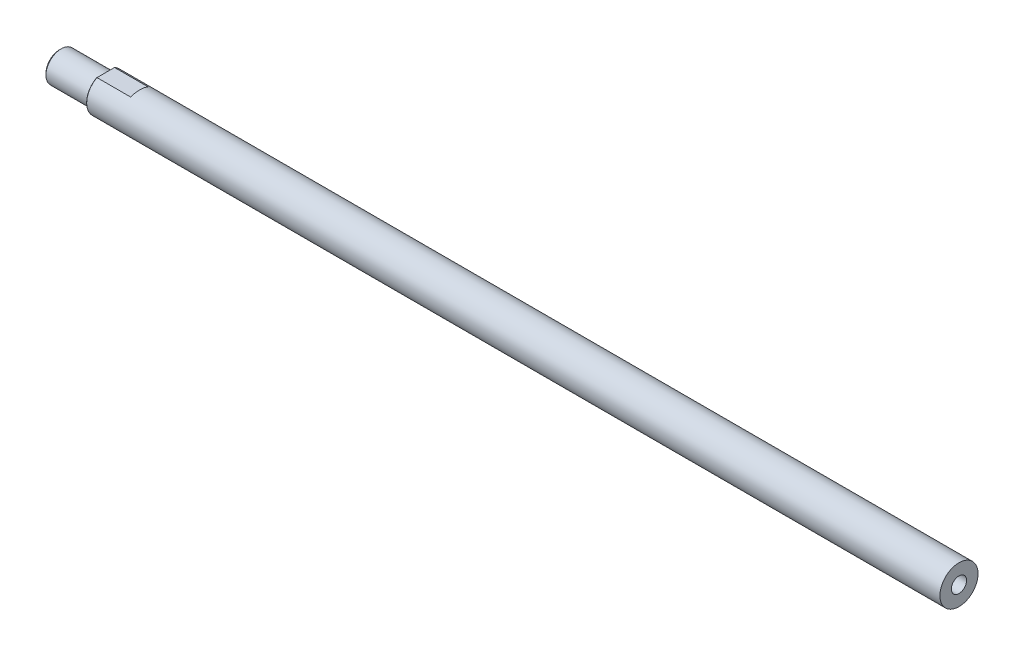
ISO-10303-21;
HEADER;
FILE_DESCRIPTION(('STEP AP214'),'2;1');
FILE_NAME('part.step','',(''),(''),'','','');
FILE_SCHEMA(('AUTOMOTIVE_DESIGN { 1 0 10303 214 1 1 1 1 }'));
ENDSEC;
DATA;
#1=APPLICATION_CONTEXT('core data for automotive mechanical design processes');
#2=APPLICATION_PROTOCOL_DEFINITION('international standard','automotive_design',2000,#1);
#3=PRODUCT_CONTEXT('',#1,'mechanical');
#4=PRODUCT('Part','Part','',(#3));
#5=PRODUCT_RELATED_PRODUCT_CATEGORY('part','',(#4));
#6=PRODUCT_DEFINITION_FORMATION('','',#4);
#7=PRODUCT_DEFINITION_CONTEXT('part definition',#1,'design');
#8=PRODUCT_DEFINITION('design','',#6,#7);
#9=PRODUCT_DEFINITION_SHAPE('','',#8);
#10=(LENGTH_UNIT() NAMED_UNIT(*) SI_UNIT(.MILLI.,.METRE.));
#11=(NAMED_UNIT(*) PLANE_ANGLE_UNIT() SI_UNIT($,.RADIAN.));
#12=(NAMED_UNIT(*) SI_UNIT($,.STERADIAN.) SOLID_ANGLE_UNIT());
#13=UNCERTAINTY_MEASURE_WITH_UNIT(LENGTH_MEASURE(1.E-05),#10,'distance_accuracy_value','');
#14=(GEOMETRIC_REPRESENTATION_CONTEXT(3) GLOBAL_UNCERTAINTY_ASSIGNED_CONTEXT((#13)) GLOBAL_UNIT_ASSIGNED_CONTEXT((#10,
#11,#12)) REPRESENTATION_CONTEXT('',''));
#15=CARTESIAN_POINT('',(0.,0.,0.));
#16=DIRECTION('',(0.,0.,1.));
#17=DIRECTION('',(1.,0.,0.));
#18=AXIS2_PLACEMENT_3D('',#15,#16,#17);
#19=CARTESIAN_POINT('',(-19.05,0.,0.));
#20=DIRECTION('',(1.,0.,0.));
#21=DIRECTION('',(0.,0.,-1.));
#22=AXIS2_PLACEMENT_3D('',#19,#20,#21);
#23=PLANE('',#22);
#24=CARTESIAN_POINT('',(-19.05,0.,0.));
#25=DIRECTION('',(1.,0.,0.));
#26=DIRECTION('',(0.,0.,-1.));
#27=AXIS2_PLACEMENT_3D('',#24,#25,#26);
#28=CIRCLE('',#27,5.58799999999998);
#29=CARTESIAN_POINT('',(-19.05,0.,-5.58799999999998));
#30=VERTEX_POINT('',#29);
#31=EDGE_CURVE('E87',#30,#30,#28,.F.);
#32=ORIENTED_EDGE('',*,*,#31,.T.);
#33=EDGE_LOOP('',(#32));
#34=FACE_BOUND('',#33,.T.);
#35=CARTESIAN_POINT('',(-19.05,0.,0.));
#36=DIRECTION('',(-1.,0.,0.));
#37=DIRECTION('',(0.,0.,1.));
#38=AXIS2_PLACEMENT_3D('',#35,#36,#37);
#39=CIRCLE('',#38,3.4544);
#40=CARTESIAN_POINT('',(-19.05,0.,3.4544));
#41=VERTEX_POINT('',#40);
#42=EDGE_CURVE('E96',#41,#41,#39,.T.);
#43=ORIENTED_EDGE('',*,*,#42,.F.);
#44=EDGE_LOOP('',(#43));
#45=FACE_BOUND('',#44,.T.);
#46=ADVANCED_FACE('F36',(#34,#45),#23,.F.);
#47=CARTESIAN_POINT('',(-34.7533783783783,0.,0.));
#48=DIRECTION('',(-1.,0.,0.));
#49=DIRECTION('',(0.,0.,1.));
#50=AXIS2_PLACEMENT_3D('',#47,#48,#49);
#51=CYLINDRICAL_SURFACE('',#50,6.35);
#52=CARTESIAN_POINT('',(-0.380999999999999,0.,0.));
#53=DIRECTION('',(1.,0.,0.));
#54=DIRECTION('',(0.,0.,-1.));
#55=AXIS2_PLACEMENT_3D('',#52,#53,#54);
#56=CIRCLE('',#55,6.35);
#57=CARTESIAN_POINT('',(-0.380999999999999,0.,-6.35));
#58=VERTEX_POINT('',#57);
#59=EDGE_CURVE('E113',#58,#58,#56,.F.);
#60=ORIENTED_EDGE('',*,*,#59,.T.);
#61=EDGE_LOOP('',(#60));
#62=FACE_BOUND('',#61,.T.);
#63=CARTESIAN_POINT('',(-18.288,0.,0.));
#64=DIRECTION('',(1.,0.,0.));
#65=DIRECTION('',(0.,0.,-1.));
#66=AXIS2_PLACEMENT_3D('',#63,#64,#65);
#67=CIRCLE('',#66,6.35);
#68=CARTESIAN_POINT('',(-18.288,0.,-6.35));
#69=VERTEX_POINT('',#68);
#70=EDGE_CURVE('E110',#69,#69,#67,.T.);
#71=ORIENTED_EDGE('',*,*,#70,.T.);
#72=EDGE_LOOP('',(#71));
#73=FACE_BOUND('',#72,.T.);
#74=ADVANCED_FACE('F146',(#62,#73),#51,.T.);
#75=CARTESIAN_POINT('',(0.,6.35,0.));
#76=DIRECTION('',(1.,0.,0.));
#77=DIRECTION('',(0.,0.,-1.));
#78=AXIS2_PLACEMENT_3D('',#75,#76,#77);
#79=PLANE('',#78);
#80=CARTESIAN_POINT('',(0.,0.,0.));
#81=DIRECTION('',(1.,0.,0.));
#82=DIRECTION('',(0.,0.,-1.));
#83=AXIS2_PLACEMENT_3D('',#80,#81,#82);
#84=CIRCLE('',#83,6.731);
#85=CARTESIAN_POINT('',(0.,0.,-6.731));
#86=VERTEX_POINT('',#85);
#87=EDGE_CURVE('E116',#86,#86,#84,.T.);
#88=ORIENTED_EDGE('',*,*,#87,.T.);
#89=EDGE_LOOP('',(#88));
#90=FACE_BOUND('',#89,.T.);
#91=CARTESIAN_POINT('',(0.,0.,0.));
#92=DIRECTION('',(1.,0.,0.));
#93=DIRECTION('',(0.,0.,-1.));
#94=AXIS2_PLACEMENT_3D('',#91,#92,#93);
#95=CIRCLE('',#94,7.68350000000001);
#96=CARTESIAN_POINT('',(0.,6.79449999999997,-3.58760951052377));
#97=VERTEX_POINT('',#96);
#98=CARTESIAN_POINT('',(0.,6.79449999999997,3.58760951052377));
#99=VERTEX_POINT('',#98);
#100=EDGE_CURVE('E119',#97,#99,#95,.F.);
#101=ORIENTED_EDGE('',*,*,#100,.T.);
#102=DIRECTION('',(0.,0.,-1.));
#103=VECTOR('',#102,1.);
#104=CARTESIAN_POINT('',(0.,6.79449999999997,0.));
#105=LINE('',#104,#103);
#106=EDGE_CURVE('E11',#99,#97,#105,.T.);
#107=ORIENTED_EDGE('',*,*,#106,.T.);
#108=EDGE_LOOP('',(#101,#107));
#109=FACE_BOUND('',#108,.T.);
#110=ADVANCED_FACE('F150',(#90,#109),#79,.F.);
#111=CARTESIAN_POINT('',(-34.7533783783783,0.,0.));
#112=DIRECTION('',(-1.,0.,0.));
#113=DIRECTION('',(0.,0.,1.));
#114=AXIS2_PLACEMENT_3D('',#111,#112,#113);
#115=CYLINDRICAL_SURFACE('',#114,7.9375);
#116=DIRECTION('',(-1.,0.,0.));
#117=VECTOR('',#116,1.);
#118=CARTESIAN_POINT('',(-34.7533783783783,7.0485,3.65000739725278));
#119=LINE('',#118,#117);
#120=CARTESIAN_POINT('',(14.224,7.0485,3.65000739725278));
#121=VERTEX_POINT('',#120);
#122=CARTESIAN_POINT('',(0.253999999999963,7.0485,3.65000739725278));
#123=VERTEX_POINT('',#122);
#124=EDGE_CURVE('E74',#121,#123,#119,.T.);
#125=ORIENTED_EDGE('',*,*,#124,.T.);
#126=CARTESIAN_POINT('',(0.253999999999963,0.,0.));
#127=DIRECTION('',(1.,0.,0.));
#128=DIRECTION('',(0.,0.,-1.));
#129=AXIS2_PLACEMENT_3D('',#126,#127,#128);
#130=CIRCLE('',#129,7.9375);
#131=CARTESIAN_POINT('',(0.253999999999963,7.0485,-3.65000739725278));
#132=VERTEX_POINT('',#131);
#133=EDGE_CURVE('E121',#123,#132,#130,.T.);
#134=ORIENTED_EDGE('',*,*,#133,.T.);
#135=DIRECTION('',(-1.,0.,0.));
#136=VECTOR('',#135,1.);
#137=CARTESIAN_POINT('',(-34.7533783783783,7.0485,-3.65000739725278));
#138=LINE('',#137,#136);
#139=CARTESIAN_POINT('',(14.224,7.0485,-3.65000739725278));
#140=VERTEX_POINT('',#139);
#141=EDGE_CURVE('E76',#132,#140,#138,.F.);
#142=ORIENTED_EDGE('',*,*,#141,.T.);
#143=CARTESIAN_POINT('',(12.3353601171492,0.,0.));
#144=DIRECTION('',(0.965925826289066,-0.25881904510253,0.));
#145=DIRECTION('',(-0.25881904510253,-0.965925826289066,0.));
#146=AXIS2_PLACEMENT_3D('',#143,#144,#145);
#147=ELLIPSE('',#146,8.21750468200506,7.9375);
#148=EDGE_CURVE('E69',#140,#121,#147,.T.);
#149=ORIENTED_EDGE('',*,*,#148,.T.);
#150=EDGE_LOOP('',(#125,#134,#142,#149));
#151=FACE_BOUND('',#150,.T.);
#152=CARTESIAN_POINT('',(355.6,0.,0.));
#153=DIRECTION('',(-1.,0.,0.));
#154=DIRECTION('',(0.,0.,1.));
#155=AXIS2_PLACEMENT_3D('',#152,#153,#154);
#156=CIRCLE('',#155,7.9375);
#157=CARTESIAN_POINT('',(355.6,0.,7.9375));
#158=VERTEX_POINT('',#157);
#159=EDGE_CURVE('E102',#158,#158,#156,.T.);
#160=ORIENTED_EDGE('',*,*,#159,.T.);
#161=EDGE_LOOP('',(#160));
#162=FACE_BOUND('',#161,.T.);
#163=ADVANCED_FACE('F71',(#151,#162),#115,.T.);
#164=CARTESIAN_POINT('',(355.6,7.9375,0.));
#165=DIRECTION('',(-1.,0.,0.));
#166=DIRECTION('',(0.,0.,1.));
#167=AXIS2_PLACEMENT_3D('',#164,#165,#166);
#168=PLANE('',#167);
#169=CARTESIAN_POINT('',(355.6,0.,0.));
#170=DIRECTION('',(1.,0.,0.));
#171=DIRECTION('',(0.,0.,-1.));
#172=AXIS2_PLACEMENT_3D('',#169,#170,#171);
#173=CIRCLE('',#172,3.175);
#174=CARTESIAN_POINT('',(355.6,0.,-3.175));
#175=VERTEX_POINT('',#174);
#176=EDGE_CURVE('E90',#175,#175,#173,.T.);
#177=ORIENTED_EDGE('',*,*,#176,.F.);
#178=EDGE_LOOP('',(#177));
#179=FACE_BOUND('',#178,.T.);
#180=ORIENTED_EDGE('',*,*,#159,.F.);
#181=EDGE_LOOP('',(#180));
#182=FACE_BOUND('',#181,.T.);
#183=ADVANCED_FACE('F157',(#179,#182),#168,.F.);
#184=CARTESIAN_POINT('',(-3.175,0.,0.));
#185=DIRECTION('',(-1.,0.,0.));
#186=DIRECTION('',(0.,0.,1.));
#187=AXIS2_PLACEMENT_3D('',#184,#185,#186);
#188=CONICAL_SURFACE('',#187,3.4544,1.02974425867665);
#189=CARTESIAN_POINT('',(-3.00711954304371,0.,0.));
#190=DIRECTION('',(-1.,0.,0.));
#191=DIRECTION('',(0.,0.,1.));
#192=AXIS2_PLACEMENT_3D('',#189,#190,#191);
#193=CIRCLE('',#192,3.175);
#194=CARTESIAN_POINT('',(-3.00711954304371,0.,-3.175));
#195=VERTEX_POINT('',#194);
#196=EDGE_CURVE('E93',#195,#195,#193,.F.);
#197=ORIENTED_EDGE('',*,*,#196,.T.);
#198=EDGE_LOOP('',(#197));
#199=FACE_BOUND('',#198,.T.);
#200=CARTESIAN_POINT('',(-3.175,0.,0.));
#201=DIRECTION('',(-1.,0.,0.));
#202=DIRECTION('',(0.,0.,1.));
#203=AXIS2_PLACEMENT_3D('',#200,#201,#202);
#204=CIRCLE('',#203,3.4544);
#205=CARTESIAN_POINT('',(-3.175,0.,3.4544));
#206=VERTEX_POINT('',#205);
#207=EDGE_CURVE('E99',#206,#206,#204,.T.);
#208=ORIENTED_EDGE('',*,*,#207,.T.);
#209=EDGE_LOOP('',(#208));
#210=FACE_BOUND('',#209,.T.);
#211=ADVANCED_FACE('F160',(#199,#210),#188,.F.);
#212=CARTESIAN_POINT('',(-19.05,0.,0.));
#213=DIRECTION('',(-1.,0.,0.));
#214=DIRECTION('',(0.,0.,1.));
#215=AXIS2_PLACEMENT_3D('',#212,#213,#214);
#216=CYLINDRICAL_SURFACE('',#215,3.4544);
#217=ORIENTED_EDGE('',*,*,#207,.F.);
#218=EDGE_LOOP('',(#217));
#219=FACE_BOUND('',#218,.T.);
#220=ORIENTED_EDGE('',*,*,#42,.T.);
#221=EDGE_LOOP('',(#220));
#222=FACE_BOUND('',#221,.T.);
#223=ADVANCED_FACE('F164',(#219,#222),#216,.F.);
#224=CARTESIAN_POINT('',(-19.05,0.,0.));
#225=DIRECTION('',(1.,0.,0.));
#226=DIRECTION('',(0.,0.,-1.));
#227=AXIS2_PLACEMENT_3D('',#224,#225,#226);
#228=CYLINDRICAL_SURFACE('',#227,3.175);
#229=CARTESIAN_POINT('',(355.6,0.,-3.175));
#230=CARTESIAN_POINT('',(351.864509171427,0.,-3.175));
#231=CARTESIAN_POINT('',(348.129018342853,0.,-3.175));
#232=CARTESIAN_POINT('',(340.658036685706,0.,-3.175));
#233=CARTESIAN_POINT('',(336.922545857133,0.,-3.175));
#234=CARTESIAN_POINT('',(329.451564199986,0.,-3.175));
#235=CARTESIAN_POINT('',(325.716073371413,0.,-3.175));
#236=CARTESIAN_POINT('',(318.245091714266,0.,-3.175));
#237=CARTESIAN_POINT('',(314.509600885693,0.,-3.175));
#238=CARTESIAN_POINT('',(307.038619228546,0.,-3.175));
#239=CARTESIAN_POINT('',(303.303128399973,0.,-3.175));
#240=CARTESIAN_POINT('',(295.832146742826,0.,-3.175));
#241=CARTESIAN_POINT('',(292.096655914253,0.,-3.175));
#242=CARTESIAN_POINT('',(284.625674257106,0.,-3.175));
#243=CARTESIAN_POINT('',(280.890183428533,0.,-3.175));
#244=CARTESIAN_POINT('',(273.419201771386,0.,-3.175));
#245=CARTESIAN_POINT('',(269.683710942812,0.,-3.175));
#246=CARTESIAN_POINT('',(262.212729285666,0.,-3.175));
#247=CARTESIAN_POINT('',(258.477238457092,0.,-3.175));
#248=CARTESIAN_POINT('',(251.006256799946,0.,-3.175));
#249=CARTESIAN_POINT('',(247.270765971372,0.,-3.175));
#250=CARTESIAN_POINT('',(239.799784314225,0.,-3.175));
#251=CARTESIAN_POINT('',(236.064293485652,0.,-3.175));
#252=CARTESIAN_POINT('',(228.593311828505,0.,-3.175));
#253=CARTESIAN_POINT('',(224.857820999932,0.,-3.175));
#254=CARTESIAN_POINT('',(217.386839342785,0.,-3.175));
#255=CARTESIAN_POINT('',(213.651348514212,0.,-3.175));
#256=CARTESIAN_POINT('',(206.180366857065,0.,-3.175));
#257=CARTESIAN_POINT('',(202.444876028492,0.,-3.175));
#258=CARTESIAN_POINT('',(194.973894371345,0.,-3.175));
#259=CARTESIAN_POINT('',(191.238403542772,0.,-3.175));
#260=CARTESIAN_POINT('',(183.767421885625,0.,-3.175));
#261=CARTESIAN_POINT('',(180.031931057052,0.,-3.175));
#262=CARTESIAN_POINT('',(172.560949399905,0.,-3.175));
#263=CARTESIAN_POINT('',(168.825458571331,0.,-3.175));
#264=CARTESIAN_POINT('',(161.354476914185,0.,-3.175));
#265=CARTESIAN_POINT('',(157.618986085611,0.,-3.175));
#266=CARTESIAN_POINT('',(150.148004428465,0.,-3.175));
#267=CARTESIAN_POINT('',(146.412513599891,0.,-3.175));
#268=CARTESIAN_POINT('',(138.941531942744,0.,-3.175));
#269=CARTESIAN_POINT('',(135.206041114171,0.,-3.175));
#270=CARTESIAN_POINT('',(127.735059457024,0.,-3.175));
#271=CARTESIAN_POINT('',(123.999568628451,0.,-3.175));
#272=CARTESIAN_POINT('',(116.528586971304,0.,-3.175));
#273=CARTESIAN_POINT('',(112.793096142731,0.,-3.175));
#274=CARTESIAN_POINT('',(105.322114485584,0.,-3.175));
#275=CARTESIAN_POINT('',(101.586623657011,0.,-3.175));
#276=CARTESIAN_POINT('',(94.1156419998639,0.,-3.175));
#277=CARTESIAN_POINT('',(90.3801511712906,0.,-3.175));
#278=CARTESIAN_POINT('',(82.9091695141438,0.,-3.175));
#279=CARTESIAN_POINT('',(79.1736786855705,0.,-3.175));
#280=CARTESIAN_POINT('',(71.7026970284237,0.,-3.175));
#281=CARTESIAN_POINT('',(67.9672061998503,0.,-3.175));
#282=CARTESIAN_POINT('',(60.4962245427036,0.,-3.175));
#283=CARTESIAN_POINT('',(56.7607337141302,0.,-3.175));
#284=CARTESIAN_POINT('',(49.2897520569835,0.,-3.175));
#285=CARTESIAN_POINT('',(45.5542612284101,0.,-3.175));
#286=CARTESIAN_POINT('',(38.0832795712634,0.,-3.175));
#287=CARTESIAN_POINT('',(34.34778874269,0.,-3.175));
#288=CARTESIAN_POINT('',(26.8768070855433,0.,-3.175));
#289=CARTESIAN_POINT('',(23.1413162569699,0.,-3.175));
#290=CARTESIAN_POINT('',(15.6703345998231,0.,-3.175));
#291=CARTESIAN_POINT('',(11.9348437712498,0.,-3.175));
#292=CARTESIAN_POINT('',(4.46386211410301,0.,-3.175));
#293=CARTESIAN_POINT('',(0.728371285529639,0.,-3.175));
#294=CARTESIAN_POINT('',(-3.00711954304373,0.,-3.175));
#295=B_SPLINE_CURVE_WITH_KNOTS('',3,(#229,#230,#231,#232,#233,#234,#235,#236,#237,#238,#239,
#240,#241,#242,#243,#244,#245,#246,#247,#248,#249,#250,#251,#252,#253,#254,#255,#256,#257,#258,
#259,#260,#261,#262,#263,#264,#265,#266,#267,#268,#269,#270,#271,#272,#273,#274,#275,#276,#277,
#278,#279,#280,#281,#282,#283,#284,#285,#286,#287,#288,#289,#290,#291,#292,#293,#294),
.UNSPECIFIED.,.F.,.F.,(4,2,2,2,2,2,2,2,2,2,2,2,2,2,2,2,2,2,2,2,2,2,2,2,2,2,2,2,2,2,2,2,4),(0.,
11.2064724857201,22.4129449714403,33.6194174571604,44.8258899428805,56.0323624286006,
67.2388349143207,78.4453074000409,89.6517798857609,100.858252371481,112.064724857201,
123.271197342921,134.477669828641,145.684142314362,156.890614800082,168.097087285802,
179.303559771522,190.510032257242,201.716504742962,212.922977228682,224.129449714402,
235.335922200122,246.542394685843,257.748867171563,268.955339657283,280.161812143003,
291.368284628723,302.574757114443,313.781229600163,324.987702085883,336.194174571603,
347.400647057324,358.607119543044),.UNSPECIFIED.);
#296=EDGE_CURVE('BSEAM168',#175,#195,#295,.T.);
#297=ORIENTED_EDGE('',*,*,#176,.T.);
#298=ORIENTED_EDGE('',*,*,#196,.F.);
#299=ORIENTED_EDGE('',*,*,#296,.T.);
#300=ORIENTED_EDGE('',*,*,#296,.F.);
#301=EDGE_LOOP('',(#297,#299,#298,#300));
#302=FACE_BOUND('',#301,.T.);
#303=ADVANCED_FACE('F168',(#302),#228,.F.);
#304=CARTESIAN_POINT('',(14.224,7.0485,-7.9375));
#305=DIRECTION('',(0.965925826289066,-0.25881904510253,0.));
#306=DIRECTION('',(0.25881904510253,0.965925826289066,0.));
#307=AXIS2_PLACEMENT_3D('',#304,#305,#306);
#308=PLANE('',#307);
#309=DIRECTION('',(0.,0.,1.));
#310=VECTOR('',#309,1.);
#311=CARTESIAN_POINT('',(14.224,7.0485,-7.9375));
#312=LINE('',#311,#310);
#313=EDGE_CURVE('E84',#140,#121,#312,.T.);
#314=ORIENTED_EDGE('',*,*,#313,.T.);
#315=ORIENTED_EDGE('',*,*,#148,.F.);
#316=EDGE_LOOP('',(#314,#315));
#317=FACE_BOUND('',#316,.T.);
#318=ADVANCED_FACE('F89',(#317),#308,.F.);
#319=CARTESIAN_POINT('',(0.,7.0485,-7.9375));
#320=DIRECTION('',(0.,-1.,0.));
#321=DIRECTION('',(0.,0.,-1.));
#322=AXIS2_PLACEMENT_3D('',#319,#320,#321);
#323=PLANE('',#322);
#324=ORIENTED_EDGE('',*,*,#141,.F.);
#325=DIRECTION('',(0.,0.,1.));
#326=VECTOR('',#325,1.);
#327=CARTESIAN_POINT('',(0.254000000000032,7.0485,-7.9375));
#328=LINE('',#327,#326);
#329=EDGE_CURVE('E86',#132,#123,#328,.T.);
#330=ORIENTED_EDGE('',*,*,#329,.T.);
#331=ORIENTED_EDGE('',*,*,#124,.F.);
#332=ORIENTED_EDGE('',*,*,#313,.F.);
#333=EDGE_LOOP('',(#324,#330,#331,#332));
#334=FACE_BOUND('',#333,.T.);
#335=ADVANCED_FACE('F83',(#334),#323,.F.);
#336=CARTESIAN_POINT('',(-19.05,0.,0.));
#337=DIRECTION('',(1.,0.,0.));
#338=DIRECTION('',(0.,0.,-1.));
#339=AXIS2_PLACEMENT_3D('',#336,#337,#338);
#340=CONICAL_SURFACE('',#339,5.58799999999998,0.78539816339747);
#341=ORIENTED_EDGE('',*,*,#70,.F.);
#342=EDGE_LOOP('',(#341));
#343=FACE_BOUND('',#342,.T.);
#344=ORIENTED_EDGE('',*,*,#31,.F.);
#345=EDGE_LOOP('',(#344));
#346=FACE_BOUND('',#345,.T.);
#347=ADVANCED_FACE('F139',(#343,#346),#340,.T.);
#348=CARTESIAN_POINT('',(-0.380999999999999,0.,0.));
#349=DIRECTION('',(1.,0.,0.));
#350=DIRECTION('',(0.,0.,-1.));
#351=AXIS2_PLACEMENT_3D('',#348,#349,#350);
#352=TOROIDAL_SURFACE('',#351,6.731,0.381);
#353=ORIENTED_EDGE('',*,*,#87,.F.);
#354=EDGE_LOOP('',(#353));
#355=FACE_BOUND('',#354,.T.);
#356=ORIENTED_EDGE('',*,*,#59,.F.);
#357=EDGE_LOOP('',(#356));
#358=FACE_BOUND('',#357,.T.);
#359=ADVANCED_FACE('F135',(#355,#358),#352,.F.);
#360=CARTESIAN_POINT('',(0.,0.,0.));
#361=DIRECTION('',(1.,0.,0.));
#362=DIRECTION('',(0.,0.,-1.));
#363=AXIS2_PLACEMENT_3D('',#360,#361,#362);
#364=CONICAL_SURFACE('',#363,7.68350000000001,0.785398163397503);
#365=ORIENTED_EDGE('',*,*,#133,.F.);
#366=CARTESIAN_POINT('',(0.254000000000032,7.0485,3.65000739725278));
#367=CARTESIAN_POINT('',(0.211655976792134,7.0061559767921,3.63969478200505));
#368=CARTESIAN_POINT('',(0.16931729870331,6.96381729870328,3.62933865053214));
#369=CARTESIAN_POINT('',(0.0846506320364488,6.87915063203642,3.6085393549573));
#370=CARTESIAN_POINT('',(0.0423226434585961,6.83682264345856,3.59809619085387));
#371=CARTESIAN_POINT('',(0.,6.79449999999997,3.58760951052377));
#372=B_SPLINE_CURVE_WITH_KNOTS('',3,(#366,#367,#368,#369,#370,#371),.UNSPECIFIED.,.F.,.F.,(4,2,
4),(0.,0.18229479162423,0.36458958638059),.UNSPECIFIED.);
#373=EDGE_CURVE('E45',#123,#99,#372,.T.);
#374=ORIENTED_EDGE('',*,*,#373,.T.);
#375=ORIENTED_EDGE('',*,*,#100,.F.);
#376=CARTESIAN_POINT('',(0.,6.79449999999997,-3.58760951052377));
#377=CARTESIAN_POINT('',(0.0423226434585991,6.83682264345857,-3.59809619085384));
#378=CARTESIAN_POINT('',(0.0846506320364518,6.87915063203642,-3.60853935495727));
#379=CARTESIAN_POINT('',(0.169317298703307,6.96381729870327,-3.62933865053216));
#380=CARTESIAN_POINT('',(0.211655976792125,7.00615597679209,-3.63969478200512));
#381=CARTESIAN_POINT('',(0.254000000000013,7.04849999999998,-3.65000739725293));
#382=B_SPLINE_CURVE_WITH_KNOTS('',3,(#376,#377,#378,#379,#380,#381),.UNSPECIFIED.,.F.,.F.,(4,2,
4),(0.,0.18229479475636,0.364589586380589),.UNSPECIFIED.);
#383=EDGE_CURVE('E124',#97,#132,#382,.T.);
#384=ORIENTED_EDGE('',*,*,#383,.T.);
#385=EDGE_LOOP('',(#365,#374,#375,#384));
#386=FACE_BOUND('',#385,.T.);
#387=ADVANCED_FACE('F131',(#386),#364,.T.);
#388=CARTESIAN_POINT('',(0.254000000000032,7.0485,-7.9375));
#389=DIRECTION('',(0.707106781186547,-0.707106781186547,0.));
#390=DIRECTION('',(0.,0.,1.));
#391=AXIS2_PLACEMENT_3D('',#388,#389,#390);
#392=PLANE('',#391);
#393=ORIENTED_EDGE('',*,*,#383,.F.);
#394=ORIENTED_EDGE('',*,*,#106,.F.);
#395=ORIENTED_EDGE('',*,*,#373,.F.);
#396=ORIENTED_EDGE('',*,*,#329,.F.);
#397=EDGE_LOOP('',(#393,#394,#395,#396));
#398=FACE_BOUND('',#397,.T.);
#399=ADVANCED_FACE('F38',(#398),#392,.F.);
#400=CLOSED_SHELL('',(#46,#74,#110,#163,#183,#211,#223,#303,#318,#335,#347,#359,#387,#399));
#401=MANIFOLD_SOLID_BREP('B2',#400);
#402=ADVANCED_BREP_SHAPE_REPRESENTATION('',(#18,#401),#14);
#403=SHAPE_DEFINITION_REPRESENTATION(#9,#402);
ENDSEC;
END-ISO-10303-21;
